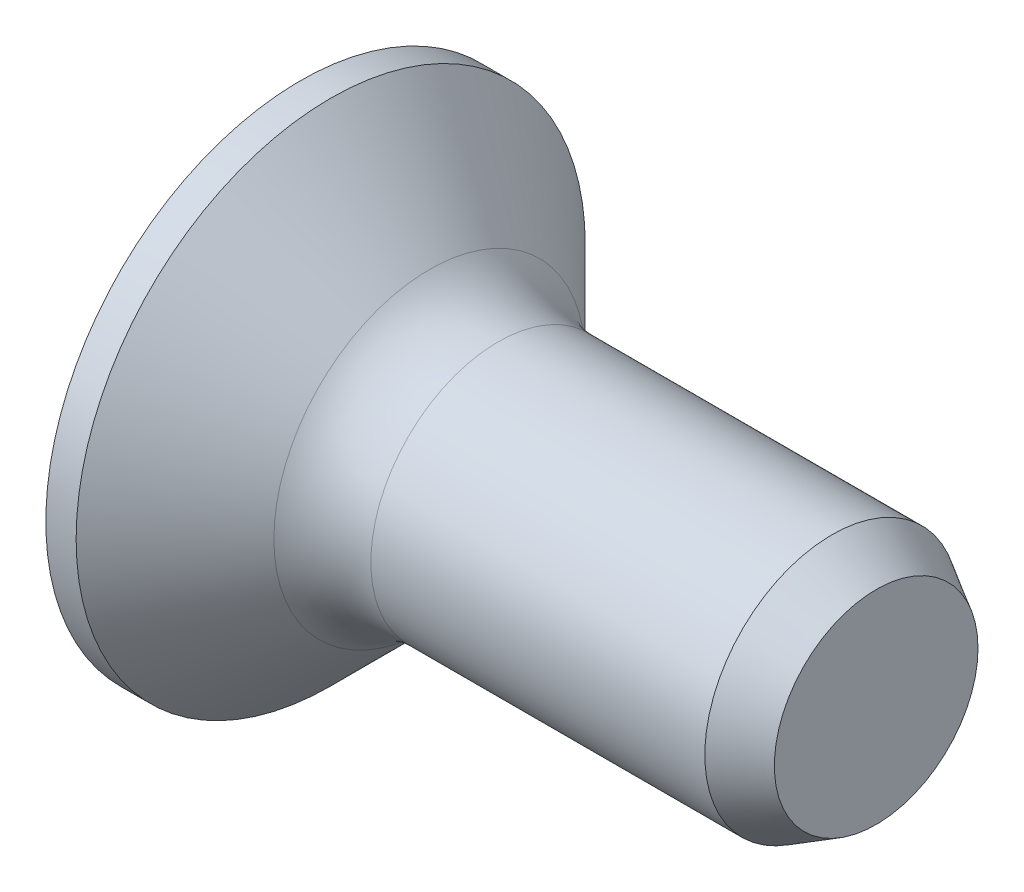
from build123d import *

# Parameters (mm, degrees)
CHAMFER1_SIZE      = 0.42
CHAMFER1_SIZE2     = 0.727461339
CUT_EXTRUDE1_DEPTH = 2.1
DRAFT1_ANGLE       = 35
DRAFT2_ANGLE       = 8
FILLET1_R          = 1.6


with BuildPart() as part:
    # Sketch1 → Revolve1 (revolve)
    with BuildSketch(Plane.XY, mode=Mode.PRIVATE) as revolve1_sk:
        Polygon((0, 4.2), (0.5, 4.2), (2.6, 2.1), (9.5, 2.1), (9.5, 0), (0, 0), align=None)
    revolve(revolve1_sk.sketch.rotate(Axis((6.620684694, 0, 0), (-1, 0, 0)), 90), axis=Axis((6.620684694, 0, 0), (-1, 0, 0)))

    # Chamfer1
    chamfer1_edges = [part.edges().sort_by_distance(p)[0] for p in [
        (9.5, 0, 2.1),
    ]]
    chamfer1_side = [part.faces().sort_by_distance(p)[0] for p in [
        (9.5, 0, 0),
    ]]
    chamfer(chamfer1_edges, length=CHAMFER1_SIZE, length2=CHAMFER1_SIZE2, reference=chamfer1_side[0])

    # Sketch4 → Cut-Extrude1 (cut)
    with BuildSketch(Plane.ZY):
        Polygon((-0.575, 2.3), (-0.575, 0.575), (-2.3, 0.575), (-2.3, -0.575), (-0.575, -0.575), (-0.575, -2.3), (0.575, -2.3), (0.575, -0.575), (2.3, -0.575), (2.3, 0.575), (0.575, 0.575), (0.575, 2.3), align=None)
    extrude(amount=-CUT_EXTRUDE1_DEPTH, mode=Mode.SUBTRACT)

    # Draft1
    draft1_faces = [part.faces().sort_by_distance(p)[0] for p in [
        (1.05, 0, 2.3),
        (1.05, 2.3, 0),
        (1.05, 0, -2.3),
        (1.05, -2.3, 0),
    ]]
    draft(draft1_faces, Plane(origin=(0, 0, 0), x_dir=(0, 0, -1), z_dir=(-1, 0, 0)), DRAFT1_ANGLE)

    # Draft2
    draft2_faces = [part.faces().sort_by_distance(p)[0] for p in [
        (0.790017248, -1.160911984, -0.575),
        (0.790017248, -0.575, -1.160911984),
        (0.790017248, -0.575, 1.160911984),
        (0.790017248, -1.160911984, 0.575),
        (0.790017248, 1.160911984, 0.575),
        (0.790017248, 0.575, 1.160911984),
        (0.790017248, 0.575, -1.160911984),
        (0.790017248, 1.160911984, -0.575),
    ]]
    draft(draft2_faces, Plane(origin=(0, 0, 0), x_dir=(0, 0, -1), z_dir=(-1, 0, 0)), DRAFT2_ANGLE)

    # Sketch6 for Cut-Loft1 → Cut-Loft1 section 0
    with BuildSketch(Plane.ZY.offset(-2.1)):
        with BuildLine():
            Line((-0.554714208, 0.279864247), (-0.554714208, -0.279864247))
            # circular arc as an exact rational Bezier (weights 1, cos(half-angle), 1)
            Bezier((-0.554714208, -0.279864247), (-0.279864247, -0.279864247), (-0.279864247, -0.554714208), weights=[1, 0.707106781, 1])
            Line((-0.279864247, -0.554714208), (0.279864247, -0.554714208))
            Bezier((0.279864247, -0.554714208), (0.279864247, -0.279864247), (0.554714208, -0.279864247), weights=[1, 0.707106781, 1])
            Line((0.554714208, -0.279864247), (0.554714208, 0.279864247))
            Bezier((0.554714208, 0.279864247), (0.279864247, 0.279864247), (0.279864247, 0.554714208), weights=[1, 0.707106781, 1])
            Line((0.279864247, 0.554714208), (-0.279864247, 0.554714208))
            Bezier((-0.279864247, 0.554714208), (-0.279864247, 0.279864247), (-0.554714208, 0.279864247), weights=[1, 0.707106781, 1])
        make_face()
    # Sketch7 for Cut-Loft1 → Cut-Loft1 section 1
    with BuildSketch(Plane.ZY):
        with BuildLine():
            Line((0.849849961, 0.575), (0.849849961, -0.575))
            Bezier((0.849849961, -0.575), (0.575, -0.575), (0.575, -0.849849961), weights=[1, 0.707106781, 1])
            Line((0.575, -0.849849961), (-0.575, -0.849849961))
            Bezier((-0.575, -0.849849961), (-0.575, -0.575), (-0.849849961, -0.575), weights=[1, 0.707106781, 1])
            Line((-0.849849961, -0.575), (-0.849849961, 0.575))
            Bezier((-0.849849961, 0.575), (-0.575, 0.575), (-0.575, 0.849849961), weights=[1, 0.707106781, 1])
            Line((-0.575, 0.849849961), (0.575, 0.849849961))
            Bezier((0.575, 0.849849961), (0.575, 0.575), (0.849849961, 0.575), weights=[1, 0.707106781, 1])
        make_face()
    loft(mode=Mode.SUBTRACT)

    # Fillet1
    fillet1_edges = [part.edges().sort_by_distance(p)[0] for p in [
        (2.6, 0, 2.1),
    ]]
    fillet(fillet1_edges, radius=FILLET1_R)


solid = part.part
